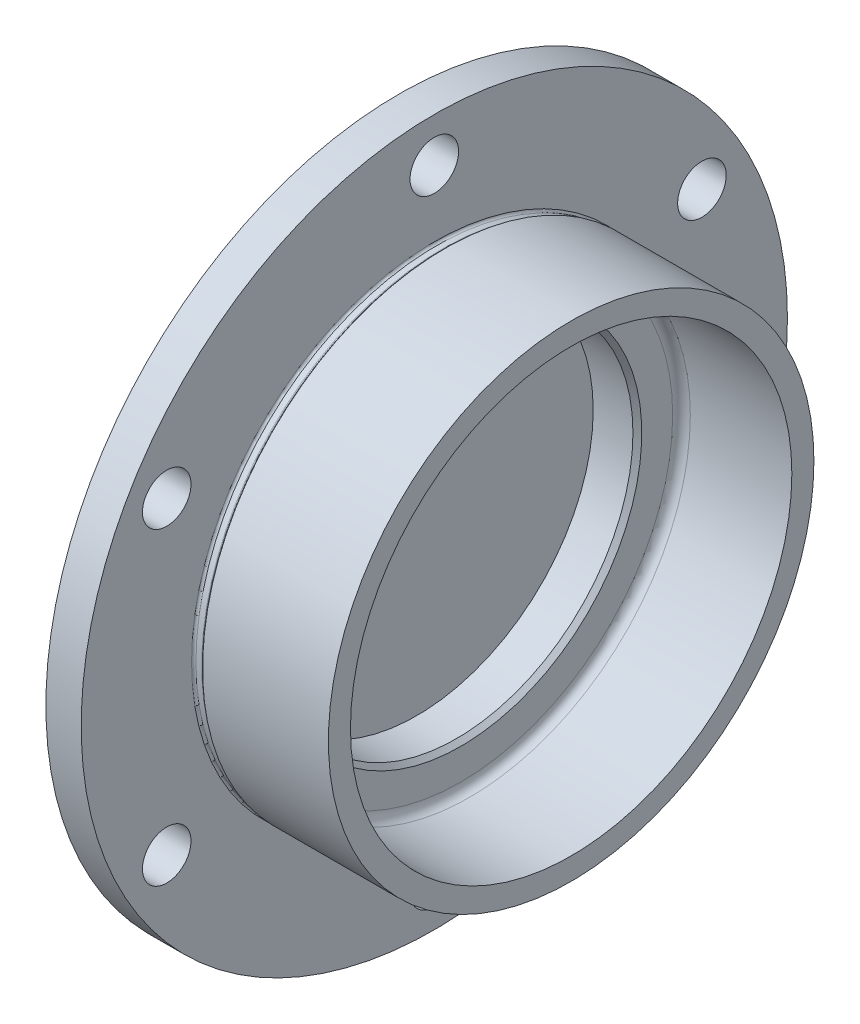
ISO-10303-21;
HEADER;
FILE_DESCRIPTION(('STEP AP214'),'2;1');
FILE_NAME('part.step','',(''),(''),'','','');
FILE_SCHEMA(('AUTOMOTIVE_DESIGN { 1 0 10303 214 1 1 1 1 }'));
ENDSEC;
DATA;
#1=APPLICATION_CONTEXT('core data for automotive mechanical design processes');
#2=APPLICATION_PROTOCOL_DEFINITION('international standard','automotive_design',2000,#1);
#3=PRODUCT_CONTEXT('',#1,'mechanical');
#4=PRODUCT('Part','Part','',(#3));
#5=PRODUCT_RELATED_PRODUCT_CATEGORY('part','',(#4));
#6=PRODUCT_DEFINITION_FORMATION('','',#4);
#7=PRODUCT_DEFINITION_CONTEXT('part definition',#1,'design');
#8=PRODUCT_DEFINITION('design','',#6,#7);
#9=PRODUCT_DEFINITION_SHAPE('','',#8);
#10=(LENGTH_UNIT() NAMED_UNIT(*) SI_UNIT(.MILLI.,.METRE.));
#11=(NAMED_UNIT(*) PLANE_ANGLE_UNIT() SI_UNIT($,.RADIAN.));
#12=(NAMED_UNIT(*) SI_UNIT($,.STERADIAN.) SOLID_ANGLE_UNIT());
#13=UNCERTAINTY_MEASURE_WITH_UNIT(LENGTH_MEASURE(1.E-05),#10,'distance_accuracy_value','');
#14=(GEOMETRIC_REPRESENTATION_CONTEXT(3) GLOBAL_UNCERTAINTY_ASSIGNED_CONTEXT((#13)) GLOBAL_UNIT_ASSIGNED_CONTEXT((#10,
#11,#12)) REPRESENTATION_CONTEXT('',''));
#15=CARTESIAN_POINT('',(0.,0.,0.));
#16=DIRECTION('',(0.,0.,1.));
#17=DIRECTION('',(1.,0.,0.));
#18=AXIS2_PLACEMENT_3D('',#15,#16,#17);
#19=CARTESIAN_POINT('',(4.,0.,0.));
#20=DIRECTION('',(-1.,0.,0.));
#21=DIRECTION('',(0.,0.,1.));
#22=AXIS2_PLACEMENT_3D('',#19,#20,#21);
#23=PLANE('',#22);
#24=CARTESIAN_POINT('',(4.,0.,0.));
#25=DIRECTION('',(1.,0.,0.));
#26=DIRECTION('',(0.,0.,-1.));
#27=AXIS2_PLACEMENT_3D('',#24,#25,#26);
#28=CIRCLE('',#27,40.);
#29=CARTESIAN_POINT('',(4.,0.,-40.));
#30=VERTEX_POINT('',#29);
#31=EDGE_CURVE('E65',#30,#30,#28,.T.);
#32=ORIENTED_EDGE('',*,*,#31,.T.);
#33=EDGE_LOOP('',(#32));
#34=FACE_BOUND('',#33,.T.);
#35=ADVANCED_FACE('F33',(#34),#23,.F.);
#36=CARTESIAN_POINT('',(29.9069920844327,0.,0.));
#37=DIRECTION('',(1.,0.,0.));
#38=DIRECTION('',(0.,0.,-1.));
#39=AXIS2_PLACEMENT_3D('',#36,#37,#38);
#40=CYLINDRICAL_SURFACE('',#39,40.);
#41=CARTESIAN_POINT('',(12.9999999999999,0.,0.));
#42=DIRECTION('',(-1.,0.,0.));
#43=DIRECTION('',(0.,0.,1.));
#44=AXIS2_PLACEMENT_3D('',#41,#42,#43);
#45=CIRCLE('',#44,40.);
#46=CARTESIAN_POINT('',(12.9999999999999,0.,40.));
#47=VERTEX_POINT('',#46);
#48=EDGE_CURVE('E48',#47,#47,#45,.F.);
#49=ORIENTED_EDGE('',*,*,#48,.T.);
#50=EDGE_LOOP('',(#49));
#51=FACE_BOUND('',#50,.T.);
#52=ORIENTED_EDGE('',*,*,#31,.F.);
#53=EDGE_LOOP('',(#52));
#54=FACE_BOUND('',#53,.T.);
#55=ADVANCED_FACE('F153',(#51,#54),#40,.F.);
#56=CARTESIAN_POINT('',(14.,0.,0.));
#57=DIRECTION('',(-1.,0.,0.));
#58=DIRECTION('',(0.,0.,1.));
#59=AXIS2_PLACEMENT_3D('',#56,#57,#58);
#60=PLANE('',#59);
#61=CARTESIAN_POINT('',(14.,0.,0.));
#62=DIRECTION('',(-1.,0.,0.));
#63=DIRECTION('',(0.,0.,1.));
#64=AXIS2_PLACEMENT_3D('',#61,#62,#63);
#65=CIRCLE('',#64,48.);
#66=CARTESIAN_POINT('',(14.,0.,48.));
#67=VERTEX_POINT('',#66);
#68=EDGE_CURVE('E40',#67,#67,#65,.F.);
#69=ORIENTED_EDGE('',*,*,#68,.T.);
#70=EDGE_LOOP('',(#69));
#71=FACE_BOUND('',#70,.T.);
#72=CARTESIAN_POINT('',(14.,0.,0.));
#73=DIRECTION('',(-1.,0.,0.));
#74=DIRECTION('',(0.,0.,1.));
#75=AXIS2_PLACEMENT_3D('',#72,#73,#74);
#76=CIRCLE('',#75,41.0000000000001);
#77=CARTESIAN_POINT('',(14.,0.,41.0000000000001));
#78=VERTEX_POINT('',#77);
#79=EDGE_CURVE('E44',#78,#78,#76,.T.);
#80=ORIENTED_EDGE('',*,*,#79,.T.);
#81=EDGE_LOOP('',(#80));
#82=FACE_BOUND('',#81,.T.);
#83=ADVANCED_FACE('F159',(#71,#82),#60,.F.);
#84=CARTESIAN_POINT('',(29.9069920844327,0.,0.));
#85=DIRECTION('',(1.,0.,0.));
#86=DIRECTION('',(0.,0.,-1.));
#87=AXIS2_PLACEMENT_3D('',#84,#85,#86);
#88=CYLINDRICAL_SURFACE('',#87,50.);
#89=CARTESIAN_POINT('',(16.,0.,0.));
#90=DIRECTION('',(-1.,0.,0.));
#91=DIRECTION('',(0.,0.,1.));
#92=AXIS2_PLACEMENT_3D('',#89,#90,#91);
#93=CIRCLE('',#92,50.);
#94=CARTESIAN_POINT('',(16.,0.,50.));
#95=VERTEX_POINT('',#94);
#96=EDGE_CURVE('E10',#95,#95,#93,.T.);
#97=ORIENTED_EDGE('',*,*,#96,.T.);
#98=EDGE_LOOP('',(#97));
#99=FACE_BOUND('',#98,.T.);
#100=CARTESIAN_POINT('',(39.,0.,0.));
#101=DIRECTION('',(1.,0.,0.));
#102=DIRECTION('',(0.,0.,-1.));
#103=AXIS2_PLACEMENT_3D('',#100,#101,#102);
#104=CIRCLE('',#103,50.);
#105=CARTESIAN_POINT('',(39.,0.,-50.));
#106=VERTEX_POINT('',#105);
#107=EDGE_CURVE('E68',#106,#106,#104,.T.);
#108=ORIENTED_EDGE('',*,*,#107,.T.);
#109=EDGE_LOOP('',(#108));
#110=FACE_BOUND('',#109,.T.);
#111=ADVANCED_FACE('F188',(#99,#110),#88,.F.);
#112=CARTESIAN_POINT('',(39.,0.,0.));
#113=DIRECTION('',(-1.,0.,0.));
#114=DIRECTION('',(0.,0.,1.));
#115=AXIS2_PLACEMENT_3D('',#112,#113,#114);
#116=PLANE('',#115);
#117=ORIENTED_EDGE('',*,*,#107,.F.);
#118=EDGE_LOOP('',(#117));
#119=FACE_BOUND('',#118,.T.);
#120=CARTESIAN_POINT('',(39.,0.,0.));
#121=DIRECTION('',(1.,0.,0.));
#122=DIRECTION('',(0.,0.,-1.));
#123=AXIS2_PLACEMENT_3D('',#120,#121,#122);
#124=CIRCLE('',#123,55.);
#125=CARTESIAN_POINT('',(39.,0.,-55.));
#126=VERTEX_POINT('',#125);
#127=EDGE_CURVE('E71',#126,#126,#124,.T.);
#128=ORIENTED_EDGE('',*,*,#127,.T.);
#129=EDGE_LOOP('',(#128));
#130=FACE_BOUND('',#129,.T.);
#131=ADVANCED_FACE('F192',(#119,#130),#116,.F.);
#132=CARTESIAN_POINT('',(29.9069920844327,0.,0.));
#133=DIRECTION('',(1.,0.,0.));
#134=DIRECTION('',(0.,0.,-1.));
#135=AXIS2_PLACEMENT_3D('',#132,#133,#134);
#136=CYLINDRICAL_SURFACE('',#135,55.);
#137=CARTESIAN_POINT('',(10.5,0.,0.));
#138=DIRECTION('',(1.,0.,0.));
#139=DIRECTION('',(0.,0.,-1.));
#140=AXIS2_PLACEMENT_3D('',#137,#138,#139);
#141=CIRCLE('',#140,55.);
#142=CARTESIAN_POINT('',(10.5,0.,-55.));
#143=VERTEX_POINT('',#142);
#144=EDGE_CURVE('E80',#143,#143,#141,.T.);
#145=ORIENTED_EDGE('',*,*,#144,.T.);
#146=EDGE_LOOP('',(#145));
#147=FACE_BOUND('',#146,.T.);
#148=ORIENTED_EDGE('',*,*,#127,.F.);
#149=EDGE_LOOP('',(#148));
#150=FACE_BOUND('',#149,.T.);
#151=ADVANCED_FACE('F197',(#147,#150),#136,.T.);
#152=CARTESIAN_POINT('',(36.050630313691,0.,0.));
#153=DIRECTION('',(1.,0.,0.));
#154=DIRECTION('',(0.,0.,-1.));
#155=AXIS2_PLACEMENT_3D('',#152,#153,#154);
#156=CYLINDRICAL_SURFACE('',#155,54.5);
#157=CARTESIAN_POINT('',(8.5,0.,0.));
#158=DIRECTION('',(-1.,0.,0.));
#159=DIRECTION('',(0.,0.,1.));
#160=AXIS2_PLACEMENT_3D('',#157,#158,#159);
#161=CIRCLE('',#160,54.5);
#162=CARTESIAN_POINT('',(8.5,0.,54.5));
#163=VERTEX_POINT('',#162);
#164=EDGE_CURVE('E59',#163,#163,#161,.F.);
#165=ORIENTED_EDGE('',*,*,#164,.T.);
#166=EDGE_LOOP('',(#165));
#167=FACE_BOUND('',#166,.T.);
#168=CARTESIAN_POINT('',(9.79289321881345,0.,0.));
#169=DIRECTION('',(1.,0.,0.));
#170=DIRECTION('',(0.,0.,-1.));
#171=AXIS2_PLACEMENT_3D('',#168,#169,#170);
#172=CIRCLE('',#171,54.5);
#173=CARTESIAN_POINT('',(9.79289321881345,0.,-54.5));
#174=VERTEX_POINT('',#173);
#175=EDGE_CURVE('E62',#174,#174,#172,.F.);
#176=ORIENTED_EDGE('',*,*,#175,.T.);
#177=EDGE_LOOP('',(#176));
#178=FACE_BOUND('',#177,.T.);
#179=ADVANCED_FACE('F200',(#167,#178),#156,.T.);
#180=CARTESIAN_POINT('',(10.,0.,0.));
#181=DIRECTION('',(1.,0.,0.));
#182=DIRECTION('',(0.,0.,-1.));
#183=AXIS2_PLACEMENT_3D('',#180,#181,#182);
#184=CONICAL_SURFACE('',#183,54.5,0.785398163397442);
#185=CARTESIAN_POINT('',(10.1464466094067,0.,0.));
#186=DIRECTION('',(1.,0.,0.));
#187=DIRECTION('',(0.,0.,-1.));
#188=AXIS2_PLACEMENT_3D('',#185,#186,#187);
#189=CIRCLE('',#188,54.6464466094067);
#190=CARTESIAN_POINT('',(10.1464466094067,0.,-54.6464466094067));
#191=VERTEX_POINT('',#190);
#192=EDGE_CURVE('E53',#191,#191,#189,.T.);
#193=ORIENTED_EDGE('',*,*,#192,.T.);
#194=EDGE_LOOP('',(#193));
#195=FACE_BOUND('',#194,.T.);
#196=ORIENTED_EDGE('',*,*,#144,.F.);
#197=EDGE_LOOP('',(#196));
#198=FACE_BOUND('',#197,.T.);
#199=ADVANCED_FACE('F127',(#195,#198),#184,.T.);
#200=CARTESIAN_POINT('',(0.,0.,0.));
#201=DIRECTION('',(1.,0.,0.));
#202=DIRECTION('',(0.,0.,-1.));
#203=AXIS2_PLACEMENT_3D('',#200,#201,#202);
#204=PLANE('',#203);
#205=CARTESIAN_POINT('',(0.,35.0000000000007,-60.6217782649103));
#206=DIRECTION('',(-1.,0.,0.));
#207=DIRECTION('',(0.,0.866025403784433,0.50000000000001));
#208=AXIS2_PLACEMENT_3D('',#205,#206,#207);
#209=CIRCLE('',#208,5.5);
#210=CARTESIAN_POINT('',(0.,39.7631397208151,-57.8717782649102));
#211=VERTEX_POINT('',#210);
#212=EDGE_CURVE('E116',#211,#211,#209,.T.);
#213=ORIENTED_EDGE('',*,*,#212,.F.);
#214=EDGE_LOOP('',(#213));
#215=FACE_BOUND('',#214,.T.);
#216=CARTESIAN_POINT('',(0.,-34.9999999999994,-60.621778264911));
#217=DIRECTION('',(-1.,0.,0.));
#218=DIRECTION('',(0.,0.866025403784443,-0.499999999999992));
#219=AXIS2_PLACEMENT_3D('',#216,#217,#218);
#220=CIRCLE('',#219,5.5);
#221=CARTESIAN_POINT('',(0.,-30.236860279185,-63.371778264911));
#222=VERTEX_POINT('',#221);
#223=EDGE_CURVE('E110',#222,#222,#220,.T.);
#224=ORIENTED_EDGE('',*,*,#223,.F.);
#225=EDGE_LOOP('',(#224));
#226=FACE_BOUND('',#225,.T.);
#227=CARTESIAN_POINT('',(0.,-70.,-4.88807387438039E-13));
#228=DIRECTION('',(-1.,0.,0.));
#229=DIRECTION('',(0.,0.,-1.));
#230=AXIS2_PLACEMENT_3D('',#227,#228,#229);
#231=CIRCLE('',#230,5.5);
#232=CARTESIAN_POINT('',(0.,-70.,-5.50000000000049));
#233=VERTEX_POINT('',#232);
#234=EDGE_CURVE('E104',#233,#233,#231,.T.);
#235=ORIENTED_EDGE('',*,*,#234,.F.);
#236=EDGE_LOOP('',(#235));
#237=FACE_BOUND('',#236,.T.);
#238=CARTESIAN_POINT('',(0.,-35.0000000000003,60.6217782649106));
#239=DIRECTION('',(-1.,0.,0.));
#240=DIRECTION('',(0.,-0.866025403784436,-0.500000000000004));
#241=AXIS2_PLACEMENT_3D('',#238,#239,#240);
#242=CIRCLE('',#241,5.5);
#243=CARTESIAN_POINT('',(0.,-39.7631397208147,57.8717782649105));
#244=VERTEX_POINT('',#243);
#245=EDGE_CURVE('E98',#244,#244,#242,.T.);
#246=ORIENTED_EDGE('',*,*,#245,.F.);
#247=EDGE_LOOP('',(#246));
#248=FACE_BOUND('',#247,.T.);
#249=CARTESIAN_POINT('',(0.,34.9999999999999,60.6217782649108));
#250=DIRECTION('',(-1.,0.,0.));
#251=DIRECTION('',(0.,-0.86602540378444,0.499999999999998));
#252=AXIS2_PLACEMENT_3D('',#249,#250,#251);
#253=CIRCLE('',#252,5.5);
#254=CARTESIAN_POINT('',(0.,30.2368602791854,63.3717782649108));
#255=VERTEX_POINT('',#254);
#256=EDGE_CURVE('E92',#255,#255,#253,.T.);
#257=ORIENTED_EDGE('',*,*,#256,.F.);
#258=EDGE_LOOP('',(#257));
#259=FACE_BOUND('',#258,.T.);
#260=CARTESIAN_POINT('',(0.,70.,0.));
#261=DIRECTION('',(-1.,0.,0.));
#262=DIRECTION('',(0.,0.,1.));
#263=AXIS2_PLACEMENT_3D('',#260,#261,#262);
#264=CIRCLE('',#263,5.5);
#265=CARTESIAN_POINT('',(0.,70.,5.5));
#266=VERTEX_POINT('',#265);
#267=EDGE_CURVE('E86',#266,#266,#264,.T.);
#268=ORIENTED_EDGE('',*,*,#267,.F.);
#269=EDGE_LOOP('',(#268));
#270=FACE_BOUND('',#269,.T.);
#271=CARTESIAN_POINT('',(0.,0.,0.));
#272=DIRECTION('',(1.,0.,0.));
#273=DIRECTION('',(0.,0.,-1.));
#274=AXIS2_PLACEMENT_3D('',#271,#272,#273);
#275=CIRCLE('',#274,80.);
#276=CARTESIAN_POINT('',(0.,0.,-80.));
#277=VERTEX_POINT('',#276);
#278=EDGE_CURVE('E77',#277,#277,#275,.T.);
#279=ORIENTED_EDGE('',*,*,#278,.F.);
#280=EDGE_LOOP('',(#279));
#281=FACE_BOUND('',#280,.T.);
#282=ADVANCED_FACE('F123',(#215,#226,#237,#248,#259,#270,#281),#204,.F.);
#283=CARTESIAN_POINT('',(29.9069920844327,0.,0.));
#284=DIRECTION('',(1.,0.,0.));
#285=DIRECTION('',(0.,0.,-1.));
#286=AXIS2_PLACEMENT_3D('',#283,#284,#285);
#287=CYLINDRICAL_SURFACE('',#286,80.);
#288=CARTESIAN_POINT('',(8.,0.,0.));
#289=DIRECTION('',(1.,0.,0.));
#290=DIRECTION('',(0.,0.,-1.));
#291=AXIS2_PLACEMENT_3D('',#288,#289,#290);
#292=CIRCLE('',#291,80.);
#293=CARTESIAN_POINT('',(8.,0.,-80.));
#294=VERTEX_POINT('',#293);
#295=EDGE_CURVE('E74',#294,#294,#292,.T.);
#296=ORIENTED_EDGE('',*,*,#295,.F.);
#297=EDGE_LOOP('',(#296));
#298=FACE_BOUND('',#297,.T.);
#299=ORIENTED_EDGE('',*,*,#278,.T.);
#300=EDGE_LOOP('',(#299));
#301=FACE_BOUND('',#300,.T.);
#302=ADVANCED_FACE('F126',(#298,#301),#287,.T.);
#303=CARTESIAN_POINT('',(8.,0.,0.));
#304=DIRECTION('',(-1.,0.,0.));
#305=DIRECTION('',(0.,0.,1.));
#306=AXIS2_PLACEMENT_3D('',#303,#304,#305);
#307=PLANE('',#306);
#308=CARTESIAN_POINT('',(8.,35.0000000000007,-60.6217782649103));
#309=DIRECTION('',(-1.,0.,0.));
#310=DIRECTION('',(0.,0.,1.));
#311=AXIS2_PLACEMENT_3D('',#308,#309,#310);
#312=CIRCLE('',#311,5.5);
#313=CARTESIAN_POINT('',(8.,35.0000000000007,-55.1217782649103));
#314=VERTEX_POINT('',#313);
#315=EDGE_CURVE('E113',#314,#314,#312,.F.);
#316=ORIENTED_EDGE('',*,*,#315,.F.);
#317=EDGE_LOOP('',(#316));
#318=FACE_BOUND('',#317,.T.);
#319=CARTESIAN_POINT('',(8.,-34.9999999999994,-60.621778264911));
#320=DIRECTION('',(-1.,0.,0.));
#321=DIRECTION('',(0.,0.,1.));
#322=AXIS2_PLACEMENT_3D('',#319,#320,#321);
#323=CIRCLE('',#322,5.5);
#324=CARTESIAN_POINT('',(8.,-34.9999999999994,-55.121778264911));
#325=VERTEX_POINT('',#324);
#326=EDGE_CURVE('E107',#325,#325,#323,.F.);
#327=ORIENTED_EDGE('',*,*,#326,.F.);
#328=EDGE_LOOP('',(#327));
#329=FACE_BOUND('',#328,.T.);
#330=CARTESIAN_POINT('',(8.,-70.,-4.88807387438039E-13));
#331=DIRECTION('',(-1.,0.,0.));
#332=DIRECTION('',(0.,0.,1.));
#333=AXIS2_PLACEMENT_3D('',#330,#331,#332);
#334=CIRCLE('',#333,5.5);
#335=CARTESIAN_POINT('',(8.,-70.,5.49999999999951));
#336=VERTEX_POINT('',#335);
#337=EDGE_CURVE('E101',#336,#336,#334,.F.);
#338=ORIENTED_EDGE('',*,*,#337,.F.);
#339=EDGE_LOOP('',(#338));
#340=FACE_BOUND('',#339,.T.);
#341=CARTESIAN_POINT('',(8.,-35.0000000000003,60.6217782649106));
#342=DIRECTION('',(-1.,0.,0.));
#343=DIRECTION('',(0.,0.,1.));
#344=AXIS2_PLACEMENT_3D('',#341,#342,#343);
#345=CIRCLE('',#344,5.5);
#346=CARTESIAN_POINT('',(8.,-35.0000000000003,66.1217782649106));
#347=VERTEX_POINT('',#346);
#348=EDGE_CURVE('E95',#347,#347,#345,.F.);
#349=ORIENTED_EDGE('',*,*,#348,.F.);
#350=EDGE_LOOP('',(#349));
#351=FACE_BOUND('',#350,.T.);
#352=CARTESIAN_POINT('',(8.,34.9999999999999,60.6217782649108));
#353=DIRECTION('',(-1.,0.,0.));
#354=DIRECTION('',(0.,0.,1.));
#355=AXIS2_PLACEMENT_3D('',#352,#353,#354);
#356=CIRCLE('',#355,5.5);
#357=CARTESIAN_POINT('',(8.,34.9999999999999,66.1217782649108));
#358=VERTEX_POINT('',#357);
#359=EDGE_CURVE('E89',#358,#358,#356,.F.);
#360=ORIENTED_EDGE('',*,*,#359,.F.);
#361=EDGE_LOOP('',(#360));
#362=FACE_BOUND('',#361,.T.);
#363=CARTESIAN_POINT('',(8.,70.,0.));
#364=DIRECTION('',(-1.,0.,0.));
#365=DIRECTION('',(0.,0.,1.));
#366=AXIS2_PLACEMENT_3D('',#363,#364,#365);
#367=CIRCLE('',#366,5.5);
#368=CARTESIAN_POINT('',(8.,70.,5.5));
#369=VERTEX_POINT('',#368);
#370=EDGE_CURVE('E83',#369,#369,#367,.F.);
#371=ORIENTED_EDGE('',*,*,#370,.F.);
#372=EDGE_LOOP('',(#371));
#373=FACE_BOUND('',#372,.T.);
#374=CARTESIAN_POINT('',(8.,0.,0.));
#375=DIRECTION('',(-1.,0.,0.));
#376=DIRECTION('',(0.,0.,1.));
#377=AXIS2_PLACEMENT_3D('',#374,#375,#376);
#378=CIRCLE('',#377,55.);
#379=CARTESIAN_POINT('',(8.,0.,55.));
#380=VERTEX_POINT('',#379);
#381=EDGE_CURVE('E56',#380,#380,#378,.T.);
#382=ORIENTED_EDGE('',*,*,#381,.T.);
#383=EDGE_LOOP('',(#382));
#384=FACE_BOUND('',#383,.T.);
#385=ORIENTED_EDGE('',*,*,#295,.T.);
#386=EDGE_LOOP('',(#385));
#387=FACE_BOUND('',#386,.T.);
#388=ADVANCED_FACE('F142',(#318,#329,#340,#351,#362,#373,#384,#387),#307,.F.);
#389=CARTESIAN_POINT('',(8.5,0.,0.));
#390=DIRECTION('',(-1.,0.,0.));
#391=DIRECTION('',(0.,0.,1.));
#392=AXIS2_PLACEMENT_3D('',#389,#390,#391);
#393=TOROIDAL_SURFACE('',#392,55.,0.5);
#394=ORIENTED_EDGE('',*,*,#381,.F.);
#395=EDGE_LOOP('',(#394));
#396=FACE_BOUND('',#395,.T.);
#397=ORIENTED_EDGE('',*,*,#164,.F.);
#398=EDGE_LOOP('',(#397));
#399=FACE_BOUND('',#398,.T.);
#400=ADVANCED_FACE('F148',(#396,#399),#393,.F.);
#401=CARTESIAN_POINT('',(9.79289321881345,0.,0.));
#402=DIRECTION('',(1.,0.,0.));
#403=DIRECTION('',(0.,0.,-1.));
#404=AXIS2_PLACEMENT_3D('',#401,#402,#403);
#405=TOROIDAL_SURFACE('',#404,55.,0.5);
#406=ORIENTED_EDGE('',*,*,#175,.F.);
#407=EDGE_LOOP('',(#406));
#408=FACE_BOUND('',#407,.T.);
#409=ORIENTED_EDGE('',*,*,#192,.F.);
#410=EDGE_LOOP('',(#409));
#411=FACE_BOUND('',#410,.T.);
#412=ADVANCED_FACE('F166',(#408,#411),#405,.F.);
#413=CARTESIAN_POINT('',(39.001,70.,0.));
#414=DIRECTION('',(-1.,0.,0.));
#415=DIRECTION('',(0.,0.,1.));
#416=AXIS2_PLACEMENT_3D('',#413,#414,#415);
#417=CYLINDRICAL_SURFACE('',#416,5.5);
#418=ORIENTED_EDGE('',*,*,#267,.T.);
#419=EDGE_LOOP('',(#418));
#420=FACE_BOUND('',#419,.T.);
#421=ORIENTED_EDGE('',*,*,#370,.T.);
#422=EDGE_LOOP('',(#421));
#423=FACE_BOUND('',#422,.T.);
#424=ADVANCED_FACE('F169',(#420,#423),#417,.F.);
#425=CARTESIAN_POINT('',(39.001,34.9999999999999,60.6217782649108));
#426=DIRECTION('',(-1.,0.,0.));
#427=DIRECTION('',(0.,0.,1.));
#428=AXIS2_PLACEMENT_3D('',#425,#426,#427);
#429=CYLINDRICAL_SURFACE('',#428,5.5);
#430=ORIENTED_EDGE('',*,*,#256,.T.);
#431=EDGE_LOOP('',(#430));
#432=FACE_BOUND('',#431,.T.);
#433=ORIENTED_EDGE('',*,*,#359,.T.);
#434=EDGE_LOOP('',(#433));
#435=FACE_BOUND('',#434,.T.);
#436=ADVANCED_FACE('F220',(#432,#435),#429,.F.);
#437=CARTESIAN_POINT('',(39.001,-35.0000000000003,60.6217782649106));
#438=DIRECTION('',(-1.,0.,0.));
#439=DIRECTION('',(0.,0.,1.));
#440=AXIS2_PLACEMENT_3D('',#437,#438,#439);
#441=CYLINDRICAL_SURFACE('',#440,5.5);
#442=ORIENTED_EDGE('',*,*,#245,.T.);
#443=EDGE_LOOP('',(#442));
#444=FACE_BOUND('',#443,.T.);
#445=ORIENTED_EDGE('',*,*,#348,.T.);
#446=EDGE_LOOP('',(#445));
#447=FACE_BOUND('',#446,.T.);
#448=ADVANCED_FACE('F224',(#444,#447),#441,.F.);
#449=CARTESIAN_POINT('',(39.001,-70.,-4.88807387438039E-13));
#450=DIRECTION('',(-1.,0.,0.));
#451=DIRECTION('',(0.,0.,1.));
#452=AXIS2_PLACEMENT_3D('',#449,#450,#451);
#453=CYLINDRICAL_SURFACE('',#452,5.5);
#454=ORIENTED_EDGE('',*,*,#234,.T.);
#455=EDGE_LOOP('',(#454));
#456=FACE_BOUND('',#455,.T.);
#457=ORIENTED_EDGE('',*,*,#337,.T.);
#458=EDGE_LOOP('',(#457));
#459=FACE_BOUND('',#458,.T.);
#460=ADVANCED_FACE('F228',(#456,#459),#453,.F.);
#461=CARTESIAN_POINT('',(39.001,-34.9999999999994,-60.621778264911));
#462=DIRECTION('',(-1.,0.,0.));
#463=DIRECTION('',(0.,0.,1.));
#464=AXIS2_PLACEMENT_3D('',#461,#462,#463);
#465=CYLINDRICAL_SURFACE('',#464,5.5);
#466=ORIENTED_EDGE('',*,*,#223,.T.);
#467=EDGE_LOOP('',(#466));
#468=FACE_BOUND('',#467,.T.);
#469=ORIENTED_EDGE('',*,*,#326,.T.);
#470=EDGE_LOOP('',(#469));
#471=FACE_BOUND('',#470,.T.);
#472=ADVANCED_FACE('F179',(#468,#471),#465,.F.);
#473=CARTESIAN_POINT('',(39.001,35.0000000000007,-60.6217782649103));
#474=DIRECTION('',(-1.,0.,0.));
#475=DIRECTION('',(0.,0.,1.));
#476=AXIS2_PLACEMENT_3D('',#473,#474,#475);
#477=CYLINDRICAL_SURFACE('',#476,5.5);
#478=ORIENTED_EDGE('',*,*,#212,.T.);
#479=EDGE_LOOP('',(#478));
#480=FACE_BOUND('',#479,.T.);
#481=ORIENTED_EDGE('',*,*,#315,.T.);
#482=EDGE_LOOP('',(#481));
#483=FACE_BOUND('',#482,.T.);
#484=ADVANCED_FACE('F120',(#480,#483),#477,.F.);
#485=CARTESIAN_POINT('',(12.9999999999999,0.,0.));
#486=DIRECTION('',(1.,0.,0.));
#487=DIRECTION('',(0.,0.,-1.));
#488=AXIS2_PLACEMENT_3D('',#485,#486,#487);
#489=CONICAL_SURFACE('',#488,40.,0.785398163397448);
#490=ORIENTED_EDGE('',*,*,#79,.F.);
#491=EDGE_LOOP('',(#490));
#492=FACE_BOUND('',#491,.T.);
#493=ORIENTED_EDGE('',*,*,#48,.F.);
#494=EDGE_LOOP('',(#493));
#495=FACE_BOUND('',#494,.T.);
#496=ADVANCED_FACE('F171',(#492,#495),#489,.F.);
#497=CARTESIAN_POINT('',(16.,0.,0.));
#498=DIRECTION('',(-1.,0.,0.));
#499=DIRECTION('',(0.,0.,1.));
#500=AXIS2_PLACEMENT_3D('',#497,#498,#499);
#501=TOROIDAL_SURFACE('',#500,48.,2.);
#502=ORIENTED_EDGE('',*,*,#96,.F.);
#503=EDGE_LOOP('',(#502));
#504=FACE_BOUND('',#503,.T.);
#505=ORIENTED_EDGE('',*,*,#68,.F.);
#506=EDGE_LOOP('',(#505));
#507=FACE_BOUND('',#506,.T.);
#508=ADVANCED_FACE('F35',(#504,#507),#501,.F.);
#509=CLOSED_SHELL('',(#35,#55,#83,#111,#131,#151,#179,#199,#282,#302,#388,#400,#412,#424,#436,
#448,#460,#472,#484,#496,#508));
#510=MANIFOLD_SOLID_BREP('B2',#509);
#511=ADVANCED_BREP_SHAPE_REPRESENTATION('',(#18,#510),#14);
#512=SHAPE_DEFINITION_REPRESENTATION(#9,#511);
ENDSEC;
END-ISO-10303-21;
